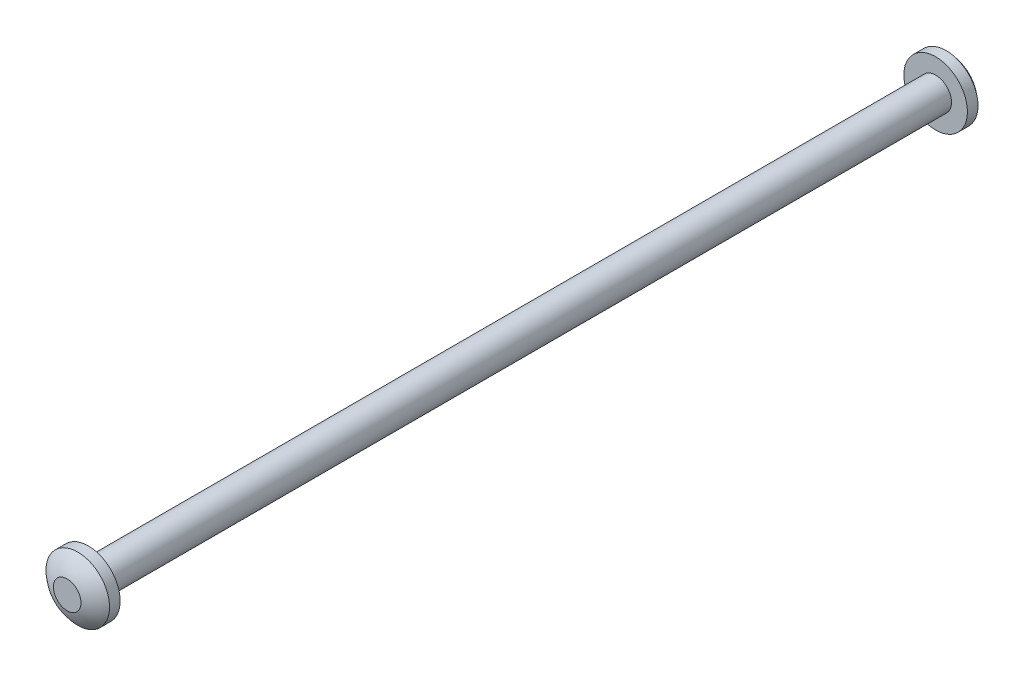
ISO-10303-21;
HEADER;
FILE_DESCRIPTION(('STEP AP214'),'2;1');
FILE_NAME('part.step','',(''),(''),'','','');
FILE_SCHEMA(('AUTOMOTIVE_DESIGN { 1 0 10303 214 1 1 1 1 }'));
ENDSEC;
DATA;
#1=APPLICATION_CONTEXT('core data for automotive mechanical design processes');
#2=APPLICATION_PROTOCOL_DEFINITION('international standard','automotive_design',2000,#1);
#3=PRODUCT_CONTEXT('',#1,'mechanical');
#4=PRODUCT('Part','Part','',(#3));
#5=PRODUCT_RELATED_PRODUCT_CATEGORY('part','',(#4));
#6=PRODUCT_DEFINITION_FORMATION('','',#4);
#7=PRODUCT_DEFINITION_CONTEXT('part definition',#1,'design');
#8=PRODUCT_DEFINITION('design','',#6,#7);
#9=PRODUCT_DEFINITION_SHAPE('','',#8);
#10=(LENGTH_UNIT() NAMED_UNIT(*) SI_UNIT(.MILLI.,.METRE.));
#11=(NAMED_UNIT(*) PLANE_ANGLE_UNIT() SI_UNIT($,.RADIAN.));
#12=(NAMED_UNIT(*) SI_UNIT($,.STERADIAN.) SOLID_ANGLE_UNIT());
#13=UNCERTAINTY_MEASURE_WITH_UNIT(LENGTH_MEASURE(1.E-05),#10,'distance_accuracy_value','');
#14=(GEOMETRIC_REPRESENTATION_CONTEXT(3) GLOBAL_UNCERTAINTY_ASSIGNED_CONTEXT((#13)) GLOBAL_UNIT_ASSIGNED_CONTEXT((#10,
#11,#12)) REPRESENTATION_CONTEXT('',''));
#15=CARTESIAN_POINT('',(0.,0.,0.));
#16=DIRECTION('',(0.,0.,1.));
#17=DIRECTION('',(1.,0.,0.));
#18=AXIS2_PLACEMENT_3D('',#15,#16,#17);
#19=CARTESIAN_POINT('',(0.,0.,-63.5));
#20=DIRECTION('',(0.,0.,1.));
#21=DIRECTION('',(1.,0.,0.));
#22=AXIS2_PLACEMENT_3D('',#19,#20,#21);
#23=CYLINDRICAL_SURFACE('',#22,1.190625);
#24=CARTESIAN_POINT('',(0.,0.,-63.5));
#25=DIRECTION('',(0.,0.,-1.));
#26=DIRECTION('',(-1.,0.,0.));
#27=AXIS2_PLACEMENT_3D('',#24,#25,#26);
#28=CIRCLE('',#27,1.190625);
#29=CARTESIAN_POINT('',(-1.190625,0.,-63.5));
#30=VERTEX_POINT('',#29);
#31=EDGE_CURVE('E52',#30,#30,#28,.F.);
#32=ORIENTED_EDGE('',*,*,#31,.T.);
#33=EDGE_LOOP('',(#32));
#34=FACE_BOUND('',#33,.T.);
#35=CARTESIAN_POINT('',(0.,0.,0.));
#36=DIRECTION('',(0.,0.,1.));
#37=DIRECTION('',(1.,0.,0.));
#38=AXIS2_PLACEMENT_3D('',#35,#36,#37);
#39=CIRCLE('',#38,1.190625);
#40=CARTESIAN_POINT('',(1.190625,0.,0.));
#41=VERTEX_POINT('',#40);
#42=EDGE_CURVE('E10',#41,#41,#39,.T.);
#43=ORIENTED_EDGE('',*,*,#42,.F.);
#44=EDGE_LOOP('',(#43));
#45=FACE_BOUND('',#44,.T.);
#46=ADVANCED_FACE('F33',(#34,#45),#23,.T.);
#47=CARTESIAN_POINT('',(0.,0.,0.79375));
#48=DIRECTION('',(0.,0.,-1.));
#49=DIRECTION('',(-1.,0.,0.));
#50=AXIS2_PLACEMENT_3D('',#47,#48,#49);
#51=CYLINDRICAL_SURFACE('',#50,2.38125);
#52=CARTESIAN_POINT('',(0.,0.,0.79375));
#53=DIRECTION('',(0.,0.,1.));
#54=DIRECTION('',(1.,0.,0.));
#55=AXIS2_PLACEMENT_3D('',#52,#53,#54);
#56=CIRCLE('',#55,2.38125);
#57=CARTESIAN_POINT('',(0.,2.38125,0.79375));
#58=VERTEX_POINT('',#57);
#59=EDGE_CURVE('E39',#58,#58,#56,.T.);
#60=ORIENTED_EDGE('',*,*,#59,.F.);
#61=EDGE_LOOP('',(#60));
#62=FACE_BOUND('',#61,.T.);
#63=CARTESIAN_POINT('',(0.,0.,0.));
#64=DIRECTION('',(0.,0.,1.));
#65=DIRECTION('',(1.,0.,0.));
#66=AXIS2_PLACEMENT_3D('',#63,#64,#65);
#67=CIRCLE('',#66,2.38125);
#68=CARTESIAN_POINT('',(2.38125,0.,0.));
#69=VERTEX_POINT('',#68);
#70=EDGE_CURVE('E43',#69,#69,#67,.T.);
#71=ORIENTED_EDGE('',*,*,#70,.T.);
#72=EDGE_LOOP('',(#71));
#73=FACE_BOUND('',#72,.T.);
#74=ADVANCED_FACE('F88',(#62,#73),#51,.T.);
#75=CARTESIAN_POINT('',(0.,0.,0.));
#76=DIRECTION('',(0.,0.,1.));
#77=DIRECTION('',(1.,0.,0.));
#78=AXIS2_PLACEMENT_3D('',#75,#76,#77);
#79=PLANE('',#78);
#80=ORIENTED_EDGE('',*,*,#42,.T.);
#81=EDGE_LOOP('',(#80));
#82=FACE_BOUND('',#81,.T.);
#83=ORIENTED_EDGE('',*,*,#70,.F.);
#84=EDGE_LOOP('',(#83));
#85=FACE_BOUND('',#84,.T.);
#86=ADVANCED_FACE('F93',(#82,#85),#79,.F.);
#87=CARTESIAN_POINT('',(0.,0.,-1.7065625));
#88=DIRECTION('',(0.,0.,-1.));
#89=DIRECTION('',(0.,1.,0.));
#90=AXIS2_PLACEMENT_3D('',#87,#88,#89);
#91=SPHERICAL_SURFACE('',#90,3.4528125);
#92=CARTESIAN_POINT('',(0.,0.,1.5875));
#93=DIRECTION('',(0.,0.,-1.));
#94=DIRECTION('',(0.,1.,0.));
#95=AXIS2_PLACEMENT_3D('',#92,#93,#94);
#96=CIRCLE('',#95,1.03492338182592);
#97=CARTESIAN_POINT('',(0.,1.03492338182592,1.5875));
#98=VERTEX_POINT('',#97);
#99=EDGE_CURVE('E48',#98,#98,#96,.T.);
#100=CARTESIAN_POINT('',(0.,1.03492338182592,1.5875));
#101=CARTESIAN_POINT('',(0.,1.05059075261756,1.58257765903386));
#102=CARTESIAN_POINT('',(0.,1.06622300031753,1.57754352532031));
#103=CARTESIAN_POINT('',(0.,1.09741407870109,1.56725273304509));
#104=CARTESIAN_POINT('',(0.,1.11297290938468,1.56199607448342));
#105=CARTESIAN_POINT('',(0.,1.14401398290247,1.55126129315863));
#106=CARTESIAN_POINT('',(0.,1.15949622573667,1.54578317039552));
#107=CARTESIAN_POINT('',(0.,1.19038097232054,1.53460657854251));
#108=CARTESIAN_POINT('',(0.,1.20578347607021,1.52890810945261));
#109=CARTESIAN_POINT('',(0.,1.23650560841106,1.517291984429));
#110=CARTESIAN_POINT('',(0.,1.25182523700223,1.51137432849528));
#111=CARTESIAN_POINT('',(0.,1.28237850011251,1.49932103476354));
#112=CARTESIAN_POINT('',(0.,1.29761213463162,1.49318539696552));
#113=CARTESIAN_POINT('',(0.,1.32799030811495,1.48069738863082));
#114=CARTESIAN_POINT('',(0.,1.34313484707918,1.47434501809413));
#115=CARTESIAN_POINT('',(0.,1.37333174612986,1.46142483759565));
#116=CARTESIAN_POINT('',(0.,1.38838410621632,1.45485702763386));
#117=CARTESIAN_POINT('',(0.,1.41839358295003,1.44150730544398));
#118=CARTESIAN_POINT('',(0.,1.43335069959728,1.43472539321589));
#119=CARTESIAN_POINT('',(0.,1.46316664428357,1.42094884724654));
#120=CARTESIAN_POINT('',(0.,1.47802547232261,1.41395421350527));
#121=CARTESIAN_POINT('',(0.,1.50764181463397,1.39975364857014));
#122=CARTESIAN_POINT('',(0.,1.5223993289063,1.39254771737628));
#123=CARTESIAN_POINT('',(0.,1.55181003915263,1.37792602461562));
#124=CARTESIAN_POINT('',(0.,1.56646323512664,1.37051026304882));
#125=CARTESIAN_POINT('',(0.,1.59566232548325,1.35547041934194));
#126=CARTESIAN_POINT('',(0.,1.61020821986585,1.34784633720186));
#127=CARTESIAN_POINT('',(0.,1.63918974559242,1.33239140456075));
#128=CARTESIAN_POINT('',(0.,1.65362537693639,1.32456055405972));
#129=CARTESIAN_POINT('',(0.,1.68238343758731,1.30869367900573));
#130=CARTESIAN_POINT('',(0.,1.69670586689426,1.30065765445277));
#131=CARTESIAN_POINT('',(0.,1.72523460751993,1.28438206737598));
#132=CARTESIAN_POINT('',(0.,1.73944091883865,1.27614250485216));
#133=CARTESIAN_POINT('',(0.,1.76773453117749,1.25946151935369));
#134=CARTESIAN_POINT('',(0.,1.78182183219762,1.25102009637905));
#135=CARTESIAN_POINT('',(0.,1.80987455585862,1.23393710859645));
#136=CARTESIAN_POINT('',(0.,1.8238399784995,1.2252955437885));
#137=CARTESIAN_POINT('',(0.,1.85164610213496,1.20781403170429));
#138=CARTESIAN_POINT('',(0.,1.86548680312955,1.19897408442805));
#139=CARTESIAN_POINT('',(0.,1.89304066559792,1.18109760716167));
#140=CARTESIAN_POINT('',(0.,1.90675382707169,1.17206107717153));
#141=CARTESIAN_POINT('',(0.,1.93404981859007,1.15379327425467));
#142=CARTESIAN_POINT('',(0.,1.94763264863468,1.14456200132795));
#143=CARTESIAN_POINT('',(0.,1.97466521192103,1.12590659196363));
#144=CARTESIAN_POINT('',(0.,1.98811494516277,1.11648245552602));
#145=CARTESIAN_POINT('',(0.,2.01487857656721,1.09744323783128));
#146=CARTESIAN_POINT('',(0.,2.02819247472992,1.08782815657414));
#147=CARTESIAN_POINT('',(0.,2.05468172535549,1.06840900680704));
#148=CARTESIAN_POINT('',(0.,2.06785707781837,1.05860493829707));
#149=CARTESIAN_POINT('',(0.,2.09406655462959,1.03880981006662));
#150=CARTESIAN_POINT('',(0.,2.10710067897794,1.02881875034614));
#151=CARTESIAN_POINT('',(0.,2.13302504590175,1.00865167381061));
#152=CARTESIAN_POINT('',(0.,2.14591528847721,0.998475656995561));
#153=CARTESIAN_POINT('',(0.,2.17154926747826,0.977940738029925));
#154=CARTESIAN_POINT('',(0.,2.18429300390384,0.967581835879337));
#155=CARTESIAN_POINT('',(0.,2.20963137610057,0.946683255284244));
#156=CARTESIAN_POINT('',(0.,2.22222601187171,0.936143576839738));
#157=CARTESIAN_POINT('',(0.,2.24726361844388,0.914885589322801));
#158=CARTESIAN_POINT('',(0.,2.25970658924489,0.904167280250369));
#159=CARTESIAN_POINT('',(0.,2.28443833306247,0.882554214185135));
#160=CARTESIAN_POINT('',(0.,2.29672710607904,0.871659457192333));
#161=CARTESIAN_POINT('',(0.,2.32114795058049,0.84969571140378));
#162=CARTESIAN_POINT('',(0.,2.33328002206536,0.83862672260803));
#163=CARTESIAN_POINT('',(0.,2.35738500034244,0.816316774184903));
#164=CARTESIAN_POINT('',(0.,2.36935790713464,0.805075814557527));
#165=CARTESIAN_POINT('',(0.,2.38125,0.79375));
#166=B_SPLINE_CURVE_WITH_KNOTS('',3,(#100,#101,#102,#103,#104,#105,#106,#107,#108,#109,#110,
#111,#112,#113,#114,#115,#116,#117,#118,#119,#120,#121,#122,#123,#124,#125,#126,#127,#128,#129,
#130,#131,#132,#133,#134,#135,#136,#137,#138,#139,#140,#141,#142,#143,#144,#145,#146,#147,#148,
#149,#150,#151,#152,#153,#154,#155,#156,#157,#158,#159,#160,#161,#162,#163,#164,#165),
.UNSPECIFIED.,.F.,.F.,(4,2,2,2,2,2,2,2,2,2,2,2,2,2,2,2,2,2,2,2,2,2,2,2,2,2,2,2,2,2,2,2,4),(0.,
0.0492668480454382,0.0985336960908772,0.147800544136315,0.197067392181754,0.246334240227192,
0.29560108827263,0.34486793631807,0.394134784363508,0.443401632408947,0.492668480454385,
0.541935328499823,0.591202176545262,0.6404690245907,0.689735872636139,0.739002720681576,
0.788269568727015,0.837536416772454,0.886803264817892,0.936070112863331,0.985336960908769,
1.03460380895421,1.08387065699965,1.13313750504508,1.18240435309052,1.23167120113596,
1.2809380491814,1.33020489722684,1.37947174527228,1.42873859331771,1.47800544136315,
1.52727228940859,1.57653913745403),.UNSPECIFIED.);
#167=EDGE_CURVE('BSEAM99',#98,#58,#166,.T.);
#168=ORIENTED_EDGE('',*,*,#99,.T.);
#169=ORIENTED_EDGE('',*,*,#59,.T.);
#170=ORIENTED_EDGE('',*,*,#167,.T.);
#171=ORIENTED_EDGE('',*,*,#167,.F.);
#172=EDGE_LOOP('',(#168,#170,#169,#171));
#173=FACE_BOUND('',#172,.T.);
#174=ADVANCED_FACE('F99',(#173),#91,.T.);
#175=CARTESIAN_POINT('',(0.,0.,1.5875));
#176=DIRECTION('',(0.,0.,1.));
#177=DIRECTION('',(0.,-1.,0.));
#178=AXIS2_PLACEMENT_3D('',#175,#176,#177);
#179=PLANE('',#178);
#180=ORIENTED_EDGE('',*,*,#99,.F.);
#181=EDGE_LOOP('',(#180));
#182=FACE_BOUND('',#181,.T.);
#183=ADVANCED_FACE('F77',(#182),#179,.T.);
#184=CARTESIAN_POINT('',(0.,0.,-64.29375));
#185=DIRECTION('',(0.,0.,1.));
#186=DIRECTION('',(1.,0.,0.));
#187=AXIS2_PLACEMENT_3D('',#184,#185,#186);
#188=CYLINDRICAL_SURFACE('',#187,2.38125);
#189=CARTESIAN_POINT('',(0.,0.,-64.29375));
#190=DIRECTION('',(0.,0.,-1.));
#191=DIRECTION('',(0.,1.,0.));
#192=AXIS2_PLACEMENT_3D('',#189,#190,#191);
#193=CIRCLE('',#192,2.38125);
#194=CARTESIAN_POINT('',(0.,2.38125,-64.29375));
#195=VERTEX_POINT('',#194);
#196=EDGE_CURVE('E58',#195,#195,#193,.T.);
#197=ORIENTED_EDGE('',*,*,#196,.F.);
#198=EDGE_LOOP('',(#197));
#199=FACE_BOUND('',#198,.T.);
#200=CARTESIAN_POINT('',(0.,0.,-63.5));
#201=DIRECTION('',(0.,0.,1.));
#202=DIRECTION('',(1.,0.,0.));
#203=AXIS2_PLACEMENT_3D('',#200,#201,#202);
#204=CIRCLE('',#203,2.38125);
#205=CARTESIAN_POINT('',(2.38125,0.,-63.5));
#206=VERTEX_POINT('',#205);
#207=EDGE_CURVE('E55',#206,#206,#204,.T.);
#208=ORIENTED_EDGE('',*,*,#207,.F.);
#209=EDGE_LOOP('',(#208));
#210=FACE_BOUND('',#209,.T.);
#211=ADVANCED_FACE('F74',(#199,#210),#188,.T.);
#212=CARTESIAN_POINT('',(0.,0.,-63.5));
#213=DIRECTION('',(0.,0.,-1.));
#214=DIRECTION('',(1.,0.,0.));
#215=AXIS2_PLACEMENT_3D('',#212,#213,#214);
#216=PLANE('',#215);
#217=ORIENTED_EDGE('',*,*,#31,.F.);
#218=EDGE_LOOP('',(#217));
#219=FACE_BOUND('',#218,.T.);
#220=ORIENTED_EDGE('',*,*,#207,.T.);
#221=EDGE_LOOP('',(#220));
#222=FACE_BOUND('',#221,.T.);
#223=ADVANCED_FACE('F70',(#219,#222),#216,.F.);
#224=CARTESIAN_POINT('',(0.,0.,-61.7934375));
#225=DIRECTION('',(0.,0.,1.));
#226=DIRECTION('',(0.,1.,0.));
#227=AXIS2_PLACEMENT_3D('',#224,#225,#226);
#228=SPHERICAL_SURFACE('',#227,3.4528125);
#229=CARTESIAN_POINT('',(0.,0.,-65.0875));
#230=DIRECTION('',(0.,0.,-1.));
#231=DIRECTION('',(0.,1.,0.));
#232=AXIS2_PLACEMENT_3D('',#229,#230,#231);
#233=CIRCLE('',#232,1.03492338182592);
#234=CARTESIAN_POINT('',(0.,1.03492338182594,-65.0875));
#235=VERTEX_POINT('',#234);
#236=EDGE_CURVE('E61',#235,#235,#233,.T.);
#237=CARTESIAN_POINT('',(0.,1.03492338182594,-65.0875));
#238=CARTESIAN_POINT('',(0.,1.05059075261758,-65.0825776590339));
#239=CARTESIAN_POINT('',(0.,1.06622300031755,-65.0775435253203));
#240=CARTESIAN_POINT('',(0.,1.0974140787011,-65.0672527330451));
#241=CARTESIAN_POINT('',(0.,1.11297290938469,-65.0619960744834));
#242=CARTESIAN_POINT('',(0.,1.14401398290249,-65.0512612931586));
#243=CARTESIAN_POINT('',(0.,1.15949622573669,-65.0457831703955));
#244=CARTESIAN_POINT('',(0.,1.19038097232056,-65.0346065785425));
#245=CARTESIAN_POINT('',(0.,1.20578347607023,-65.0289081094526));
#246=CARTESIAN_POINT('',(0.,1.23650560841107,-65.017291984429));
#247=CARTESIAN_POINT('',(0.,1.25182523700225,-65.0113743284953));
#248=CARTESIAN_POINT('',(0.,1.28237850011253,-64.9993210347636));
#249=CARTESIAN_POINT('',(0.,1.29761213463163,-64.9931853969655));
#250=CARTESIAN_POINT('',(0.,1.32799030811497,-64.9806973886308));
#251=CARTESIAN_POINT('',(0.,1.34313484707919,-64.9743450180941));
#252=CARTESIAN_POINT('',(0.,1.37333174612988,-64.9614248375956));
#253=CARTESIAN_POINT('',(0.,1.38838410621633,-64.9548570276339));
#254=CARTESIAN_POINT('',(0.,1.41839358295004,-64.941507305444));
#255=CARTESIAN_POINT('',(0.,1.43335069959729,-64.9347253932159));
#256=CARTESIAN_POINT('',(0.,1.46316664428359,-64.9209488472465));
#257=CARTESIAN_POINT('',(0.,1.47802547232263,-64.9139542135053));
#258=CARTESIAN_POINT('',(0.,1.50764181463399,-64.8997536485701));
#259=CARTESIAN_POINT('',(0.,1.52239932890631,-64.8925477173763));
#260=CARTESIAN_POINT('',(0.,1.55181003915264,-64.8779260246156));
#261=CARTESIAN_POINT('',(0.,1.56646323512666,-64.8705102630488));
#262=CARTESIAN_POINT('',(0.,1.59566232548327,-64.855470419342));
#263=CARTESIAN_POINT('',(0.,1.61020821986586,-64.8478463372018));
#264=CARTESIAN_POINT('',(0.,1.63918974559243,-64.8323914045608));
#265=CARTESIAN_POINT('',(0.,1.6536253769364,-64.8245605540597));
#266=CARTESIAN_POINT('',(0.,1.68238343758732,-64.8086936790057));
#267=CARTESIAN_POINT('',(0.,1.69670586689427,-64.8006576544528));
#268=CARTESIAN_POINT('',(0.,1.72523460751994,-64.784382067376));
#269=CARTESIAN_POINT('',(0.,1.73944091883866,-64.7761425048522));
#270=CARTESIAN_POINT('',(0.,1.7677345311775,-64.7594615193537));
#271=CARTESIAN_POINT('',(0.,1.78182183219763,-64.7510200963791));
#272=CARTESIAN_POINT('',(0.,1.80987455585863,-64.7339371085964));
#273=CARTESIAN_POINT('',(0.,1.8238399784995,-64.7252955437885));
#274=CARTESIAN_POINT('',(0.,1.85164610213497,-64.7078140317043));
#275=CARTESIAN_POINT('',(0.,1.86548680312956,-64.6989740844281));
#276=CARTESIAN_POINT('',(0.,1.89304066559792,-64.6810976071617));
#277=CARTESIAN_POINT('',(0.,1.9067538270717,-64.6720610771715));
#278=CARTESIAN_POINT('',(0.,1.93404981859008,-64.6537932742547));
#279=CARTESIAN_POINT('',(0.,1.94763264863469,-64.644562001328));
#280=CARTESIAN_POINT('',(0.,1.97466521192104,-64.6259065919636));
#281=CARTESIAN_POINT('',(0.,1.98811494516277,-64.616482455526));
#282=CARTESIAN_POINT('',(0.,2.01487857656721,-64.5974432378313));
#283=CARTESIAN_POINT('',(0.,2.02819247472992,-64.5878281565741));
#284=CARTESIAN_POINT('',(0.,2.0546817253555,-64.568409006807));
#285=CARTESIAN_POINT('',(0.,2.06785707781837,-64.5586049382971));
#286=CARTESIAN_POINT('',(0.,2.09406655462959,-64.5388098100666));
#287=CARTESIAN_POINT('',(0.,2.10710067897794,-64.5288187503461));
#288=CARTESIAN_POINT('',(0.,2.13302504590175,-64.5086516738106));
#289=CARTESIAN_POINT('',(0.,2.14591528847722,-64.4984756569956));
#290=CARTESIAN_POINT('',(0.,2.17154926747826,-64.4779407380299));
#291=CARTESIAN_POINT('',(0.,2.18429300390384,-64.4675818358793));
#292=CARTESIAN_POINT('',(0.,2.20963137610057,-64.4466832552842));
#293=CARTESIAN_POINT('',(0.,2.22222601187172,-64.4361435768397));
#294=CARTESIAN_POINT('',(0.,2.24726361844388,-64.4148855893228));
#295=CARTESIAN_POINT('',(0.,2.25970658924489,-64.4041672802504));
#296=CARTESIAN_POINT('',(0.,2.28443833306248,-64.3825542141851));
#297=CARTESIAN_POINT('',(0.,2.29672710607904,-64.3716594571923));
#298=CARTESIAN_POINT('',(0.,2.32114795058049,-64.3496957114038));
#299=CARTESIAN_POINT('',(0.,2.33328002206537,-64.338626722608));
#300=CARTESIAN_POINT('',(0.,2.35738500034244,-64.3163167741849));
#301=CARTESIAN_POINT('',(0.,2.36935790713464,-64.3050758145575));
#302=CARTESIAN_POINT('',(0.,2.38125,-64.29375));
#303=B_SPLINE_CURVE_WITH_KNOTS('',3,(#237,#238,#239,#240,#241,#242,#243,#244,#245,#246,#247,
#248,#249,#250,#251,#252,#253,#254,#255,#256,#257,#258,#259,#260,#261,#262,#263,#264,#265,#266,
#267,#268,#269,#270,#271,#272,#273,#274,#275,#276,#277,#278,#279,#280,#281,#282,#283,#284,#285,
#286,#287,#288,#289,#290,#291,#292,#293,#294,#295,#296,#297,#298,#299,#300,#301,#302),
.UNSPECIFIED.,.F.,.F.,(4,2,2,2,2,2,2,2,2,2,2,2,2,2,2,2,2,2,2,2,2,2,2,2,2,2,2,2,2,2,2,2,4),(0.,
0.0492668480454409,0.0985336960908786,0.147800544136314,0.197067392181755,0.246334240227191,
0.295601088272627,0.34486793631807,0.394134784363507,0.443401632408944,0.492668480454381,
0.541935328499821,0.591202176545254,0.640469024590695,0.689735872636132,0.739002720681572,
0.788269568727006,0.83753641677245,0.886803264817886,0.936070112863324,0.985336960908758,
1.0346038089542,1.08387065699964,1.13313750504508,1.18240435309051,1.23167120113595,
1.28093804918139,1.33020489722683,1.37947174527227,1.4287385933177,1.47800544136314,
1.52727228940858,1.57653913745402),.UNSPECIFIED.);
#304=EDGE_CURVE('BSEAM67',#235,#195,#303,.T.);
#305=ORIENTED_EDGE('',*,*,#236,.F.);
#306=ORIENTED_EDGE('',*,*,#196,.T.);
#307=ORIENTED_EDGE('',*,*,#304,.T.);
#308=ORIENTED_EDGE('',*,*,#304,.F.);
#309=EDGE_LOOP('',(#305,#307,#306,#308));
#310=FACE_BOUND('',#309,.T.);
#311=ADVANCED_FACE('F67',(#310),#228,.T.);
#312=CARTESIAN_POINT('',(0.,0.,-65.0875));
#313=DIRECTION('',(0.,0.,-1.));
#314=DIRECTION('',(0.,-1.,0.));
#315=AXIS2_PLACEMENT_3D('',#312,#313,#314);
#316=PLANE('',#315);
#317=ORIENTED_EDGE('',*,*,#236,.T.);
#318=EDGE_LOOP('',(#317));
#319=FACE_BOUND('',#318,.T.);
#320=ADVANCED_FACE('F65',(#319),#316,.T.);
#321=CLOSED_SHELL('',(#46,#74,#86,#174,#183,#211,#223,#311,#320));
#322=MANIFOLD_SOLID_BREP('B2',#321);
#323=ADVANCED_BREP_SHAPE_REPRESENTATION('',(#18,#322),#14);
#324=SHAPE_DEFINITION_REPRESENTATION(#9,#323);
ENDSEC;
END-ISO-10303-21;
